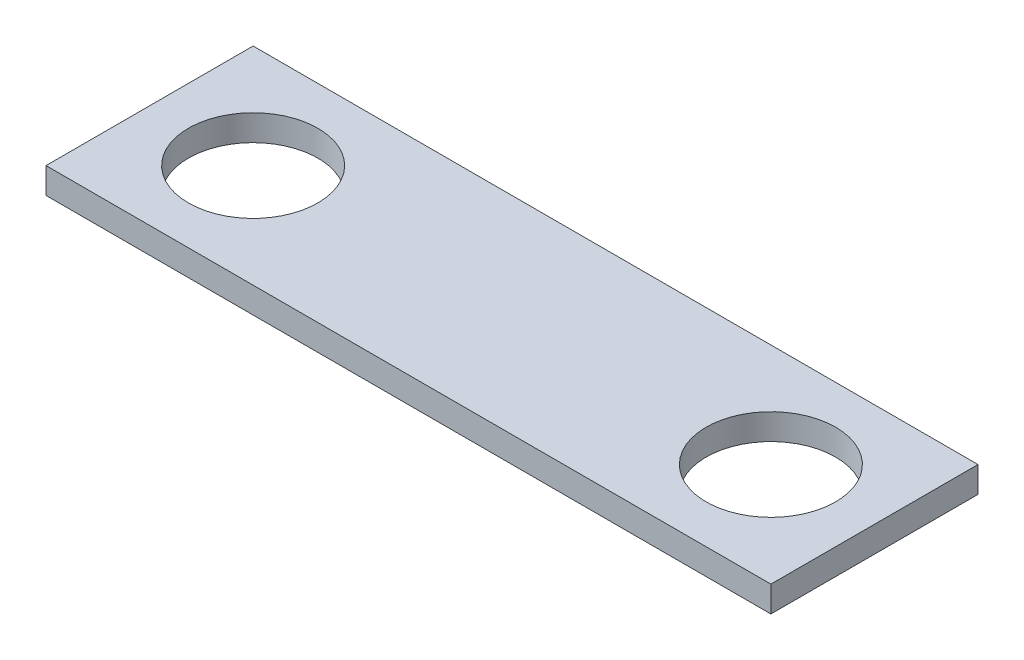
ISO-10303-21;
HEADER;
FILE_DESCRIPTION(('STEP AP214'),'2;1');
FILE_NAME('part.step','',(''),(''),'','','');
FILE_SCHEMA(('AUTOMOTIVE_DESIGN { 1 0 10303 214 1 1 1 1 }'));
ENDSEC;
DATA;
#1=APPLICATION_CONTEXT('core data for automotive mechanical design processes');
#2=APPLICATION_PROTOCOL_DEFINITION('international standard','automotive_design',2000,#1);
#3=PRODUCT_CONTEXT('',#1,'mechanical');
#4=PRODUCT('Part','Part','',(#3));
#5=PRODUCT_RELATED_PRODUCT_CATEGORY('part','',(#4));
#6=PRODUCT_DEFINITION_FORMATION('','',#4);
#7=PRODUCT_DEFINITION_CONTEXT('part definition',#1,'design');
#8=PRODUCT_DEFINITION('design','',#6,#7);
#9=PRODUCT_DEFINITION_SHAPE('','',#8);
#10=(LENGTH_UNIT() NAMED_UNIT(*) SI_UNIT(.MILLI.,.METRE.));
#11=(NAMED_UNIT(*) PLANE_ANGLE_UNIT() SI_UNIT($,.RADIAN.));
#12=(NAMED_UNIT(*) SI_UNIT($,.STERADIAN.) SOLID_ANGLE_UNIT());
#13=UNCERTAINTY_MEASURE_WITH_UNIT(LENGTH_MEASURE(1.E-05),#10,'distance_accuracy_value','');
#14=(GEOMETRIC_REPRESENTATION_CONTEXT(3) GLOBAL_UNCERTAINTY_ASSIGNED_CONTEXT((#13)) GLOBAL_UNIT_ASSIGNED_CONTEXT((#10,
#11,#12)) REPRESENTATION_CONTEXT('',''));
#15=CARTESIAN_POINT('',(0.,0.,0.));
#16=DIRECTION('',(0.,0.,1.));
#17=DIRECTION('',(1.,0.,0.));
#18=AXIS2_PLACEMENT_3D('',#15,#16,#17);
#19=CARTESIAN_POINT('',(0.,0.5,0.));
#20=DIRECTION('',(1.,0.,0.));
#21=DIRECTION('',(0.,0.,-1.));
#22=AXIS2_PLACEMENT_3D('',#19,#20,#21);
#23=PLANE('',#22);
#24=DIRECTION('',(0.,0.,1.));
#25=VECTOR('',#24,1.);
#26=CARTESIAN_POINT('',(0.,0.,0.));
#27=LINE('',#26,#25);
#28=CARTESIAN_POINT('',(0.,0.,-4.));
#29=VERTEX_POINT('',#28);
#30=CARTESIAN_POINT('',(0.,0.,0.));
#31=VERTEX_POINT('',#30);
#32=EDGE_CURVE('E97',#29,#31,#27,.T.);
#33=ORIENTED_EDGE('',*,*,#32,.T.);
#34=DIRECTION('',(0.,-1.,0.));
#35=VECTOR('',#34,1.);
#36=CARTESIAN_POINT('',(0.,0.5,0.));
#37=LINE('',#36,#35);
#38=CARTESIAN_POINT('',(0.,0.5,0.));
#39=VERTEX_POINT('',#38);
#40=EDGE_CURVE('E11',#39,#31,#37,.T.);
#41=ORIENTED_EDGE('',*,*,#40,.F.);
#42=DIRECTION('',(0.,0.,1.));
#43=VECTOR('',#42,1.);
#44=CARTESIAN_POINT('',(0.,0.5,0.));
#45=LINE('',#44,#43);
#46=CARTESIAN_POINT('',(0.,0.5,-4.));
#47=VERTEX_POINT('',#46);
#48=EDGE_CURVE('E85',#47,#39,#45,.T.);
#49=ORIENTED_EDGE('',*,*,#48,.F.);
#50=DIRECTION('',(0.,-1.,0.));
#51=VECTOR('',#50,1.);
#52=CARTESIAN_POINT('',(0.,0.5,-4.));
#53=LINE('',#52,#51);
#54=EDGE_CURVE('E93',#47,#29,#53,.T.);
#55=ORIENTED_EDGE('',*,*,#54,.T.);
#56=EDGE_LOOP('',(#33,#41,#49,#55));
#57=FACE_BOUND('',#56,.T.);
#58=ADVANCED_FACE('F34',(#57),#23,.F.);
#59=CARTESIAN_POINT('',(0.,0.5,0.));
#60=DIRECTION('',(0.,0.,-1.));
#61=DIRECTION('',(-1.,0.,0.));
#62=AXIS2_PLACEMENT_3D('',#59,#60,#61);
#63=PLANE('',#62);
#64=DIRECTION('',(1.,0.,0.));
#65=VECTOR('',#64,1.);
#66=CARTESIAN_POINT('',(0.,0.,0.));
#67=LINE('',#66,#65);
#68=CARTESIAN_POINT('',(14.,0.,0.));
#69=VERTEX_POINT('',#68);
#70=EDGE_CURVE('E89',#31,#69,#67,.T.);
#71=ORIENTED_EDGE('',*,*,#70,.T.);
#72=DIRECTION('',(0.,-1.,0.));
#73=VECTOR('',#72,1.);
#74=CARTESIAN_POINT('',(14.,0.5,0.));
#75=LINE('',#74,#73);
#76=CARTESIAN_POINT('',(14.,0.5,0.));
#77=VERTEX_POINT('',#76);
#78=EDGE_CURVE('E42',#77,#69,#75,.T.);
#79=ORIENTED_EDGE('',*,*,#78,.F.);
#80=DIRECTION('',(1.,0.,0.));
#81=VECTOR('',#80,1.);
#82=CARTESIAN_POINT('',(0.,0.5,0.));
#83=LINE('',#82,#81);
#84=EDGE_CURVE('E80',#39,#77,#83,.T.);
#85=ORIENTED_EDGE('',*,*,#84,.F.);
#86=ORIENTED_EDGE('',*,*,#40,.T.);
#87=EDGE_LOOP('',(#71,#79,#85,#86));
#88=FACE_BOUND('',#87,.T.);
#89=ADVANCED_FACE('F88',(#88),#63,.F.);
#90=CARTESIAN_POINT('',(14.,0.5,0.));
#91=DIRECTION('',(-1.,0.,0.));
#92=DIRECTION('',(0.,0.,1.));
#93=AXIS2_PLACEMENT_3D('',#90,#91,#92);
#94=PLANE('',#93);
#95=DIRECTION('',(0.,0.,-1.));
#96=VECTOR('',#95,1.);
#97=CARTESIAN_POINT('',(14.,0.,0.));
#98=LINE('',#97,#96);
#99=CARTESIAN_POINT('',(14.,0.,-4.));
#100=VERTEX_POINT('',#99);
#101=EDGE_CURVE('E67',#69,#100,#98,.T.);
#102=ORIENTED_EDGE('',*,*,#101,.T.);
#103=DIRECTION('',(0.,-1.,0.));
#104=VECTOR('',#103,1.);
#105=CARTESIAN_POINT('',(14.,0.5,-4.));
#106=LINE('',#105,#104);
#107=CARTESIAN_POINT('',(14.,0.5,-4.));
#108=VERTEX_POINT('',#107);
#109=EDGE_CURVE('E90',#108,#100,#106,.T.);
#110=ORIENTED_EDGE('',*,*,#109,.F.);
#111=DIRECTION('',(0.,0.,-1.));
#112=VECTOR('',#111,1.);
#113=CARTESIAN_POINT('',(14.,0.5,0.));
#114=LINE('',#113,#112);
#115=EDGE_CURVE('E83',#77,#108,#114,.T.);
#116=ORIENTED_EDGE('',*,*,#115,.F.);
#117=ORIENTED_EDGE('',*,*,#78,.T.);
#118=EDGE_LOOP('',(#102,#110,#116,#117));
#119=FACE_BOUND('',#118,.T.);
#120=ADVANCED_FACE('F91',(#119),#94,.F.);
#121=CARTESIAN_POINT('',(0.,0.5,-4.));
#122=DIRECTION('',(0.,0.,1.));
#123=DIRECTION('',(1.,0.,0.));
#124=AXIS2_PLACEMENT_3D('',#121,#122,#123);
#125=PLANE('',#124);
#126=DIRECTION('',(-1.,0.,0.));
#127=VECTOR('',#126,1.);
#128=CARTESIAN_POINT('',(0.,0.,-4.));
#129=LINE('',#128,#127);
#130=EDGE_CURVE('E73',#100,#29,#129,.T.);
#131=ORIENTED_EDGE('',*,*,#130,.T.);
#132=ORIENTED_EDGE('',*,*,#54,.F.);
#133=DIRECTION('',(-1.,0.,0.));
#134=VECTOR('',#133,1.);
#135=CARTESIAN_POINT('',(0.,0.5,-4.));
#136=LINE('',#135,#134);
#137=EDGE_CURVE('E50',#108,#47,#136,.T.);
#138=ORIENTED_EDGE('',*,*,#137,.F.);
#139=ORIENTED_EDGE('',*,*,#109,.T.);
#140=EDGE_LOOP('',(#131,#132,#138,#139));
#141=FACE_BOUND('',#140,.T.);
#142=ADVANCED_FACE('F105',(#141),#125,.F.);
#143=CARTESIAN_POINT('',(0.,0.5,-4.));
#144=DIRECTION('',(0.,-1.,0.));
#145=DIRECTION('',(0.,0.,-1.));
#146=AXIS2_PLACEMENT_3D('',#143,#144,#145);
#147=PLANE('',#146);
#148=CARTESIAN_POINT('',(12.,0.5,-2.));
#149=DIRECTION('',(0.,1.,0.));
#150=DIRECTION('',(0.,0.,-1.));
#151=AXIS2_PLACEMENT_3D('',#148,#149,#150);
#152=CIRCLE('',#151,1.25);
#153=CARTESIAN_POINT('',(12.,0.5,-3.25));
#154=VERTEX_POINT('',#153);
#155=EDGE_CURVE('E117',#154,#154,#152,.T.);
#156=ORIENTED_EDGE('',*,*,#155,.F.);
#157=EDGE_LOOP('',(#156));
#158=FACE_BOUND('',#157,.T.);
#159=CARTESIAN_POINT('',(2.,0.5,-2.));
#160=DIRECTION('',(0.,1.,0.));
#161=DIRECTION('',(0.,0.,1.));
#162=AXIS2_PLACEMENT_3D('',#159,#160,#161);
#163=CIRCLE('',#162,1.25);
#164=CARTESIAN_POINT('',(2.,0.5,-0.75));
#165=VERTEX_POINT('',#164);
#166=EDGE_CURVE('E111',#165,#165,#163,.T.);
#167=ORIENTED_EDGE('',*,*,#166,.F.);
#168=EDGE_LOOP('',(#167));
#169=FACE_BOUND('',#168,.T.);
#170=ORIENTED_EDGE('',*,*,#48,.T.);
#171=ORIENTED_EDGE('',*,*,#84,.T.);
#172=ORIENTED_EDGE('',*,*,#115,.T.);
#173=ORIENTED_EDGE('',*,*,#137,.T.);
#174=EDGE_LOOP('',(#170,#171,#172,#173));
#175=FACE_BOUND('',#174,.T.);
#176=ADVANCED_FACE('F81',(#158,#169,#175),#147,.F.);
#177=CARTESIAN_POINT('',(0.,0.,-4.));
#178=DIRECTION('',(0.,-1.,0.));
#179=DIRECTION('',(0.,0.,-1.));
#180=AXIS2_PLACEMENT_3D('',#177,#178,#179);
#181=PLANE('',#180);
#182=CARTESIAN_POINT('',(12.,0.,-2.));
#183=DIRECTION('',(0.,1.,0.));
#184=DIRECTION('',(0.,0.,-1.));
#185=AXIS2_PLACEMENT_3D('',#182,#183,#184);
#186=CIRCLE('',#185,1.25);
#187=CARTESIAN_POINT('',(12.,0.,-3.25));
#188=VERTEX_POINT('',#187);
#189=EDGE_CURVE('E114',#188,#188,#186,.T.);
#190=ORIENTED_EDGE('',*,*,#189,.T.);
#191=EDGE_LOOP('',(#190));
#192=FACE_BOUND('',#191,.T.);
#193=CARTESIAN_POINT('',(2.,0.,-2.));
#194=DIRECTION('',(0.,1.,0.));
#195=DIRECTION('',(0.,0.,1.));
#196=AXIS2_PLACEMENT_3D('',#193,#194,#195);
#197=CIRCLE('',#196,1.25);
#198=CARTESIAN_POINT('',(2.,0.,-0.75));
#199=VERTEX_POINT('',#198);
#200=EDGE_CURVE('E100',#199,#199,#197,.T.);
#201=ORIENTED_EDGE('',*,*,#200,.T.);
#202=EDGE_LOOP('',(#201));
#203=FACE_BOUND('',#202,.T.);
#204=ORIENTED_EDGE('',*,*,#32,.F.);
#205=ORIENTED_EDGE('',*,*,#130,.F.);
#206=ORIENTED_EDGE('',*,*,#101,.F.);
#207=ORIENTED_EDGE('',*,*,#70,.F.);
#208=EDGE_LOOP('',(#204,#205,#206,#207));
#209=FACE_BOUND('',#208,.T.);
#210=ADVANCED_FACE('F108',(#192,#203,#209),#181,.T.);
#211=CARTESIAN_POINT('',(2.,0.,-2.));
#212=DIRECTION('',(0.,1.,0.));
#213=DIRECTION('',(0.,0.,1.));
#214=AXIS2_PLACEMENT_3D('',#211,#212,#213);
#215=CYLINDRICAL_SURFACE('',#214,1.25);
#216=ORIENTED_EDGE('',*,*,#200,.F.);
#217=EDGE_LOOP('',(#216));
#218=FACE_BOUND('',#217,.T.);
#219=ORIENTED_EDGE('',*,*,#166,.T.);
#220=EDGE_LOOP('',(#219));
#221=FACE_BOUND('',#220,.T.);
#222=ADVANCED_FACE('F128',(#218,#221),#215,.F.);
#223=CARTESIAN_POINT('',(12.,0.,-2.));
#224=DIRECTION('',(0.,1.,0.));
#225=DIRECTION('',(0.,0.,1.));
#226=AXIS2_PLACEMENT_3D('',#223,#224,#225);
#227=CYLINDRICAL_SURFACE('',#226,1.25);
#228=ORIENTED_EDGE('',*,*,#189,.F.);
#229=EDGE_LOOP('',(#228));
#230=FACE_BOUND('',#229,.T.);
#231=ORIENTED_EDGE('',*,*,#155,.T.);
#232=EDGE_LOOP('',(#231));
#233=FACE_BOUND('',#232,.T.);
#234=ADVANCED_FACE('F125',(#230,#233),#227,.F.);
#235=CLOSED_SHELL('',(#58,#89,#120,#142,#176,#210,#222,#234));
#236=MANIFOLD_SOLID_BREP('B2',#235);
#237=ADVANCED_BREP_SHAPE_REPRESENTATION('',(#18,#236),#14);
#238=SHAPE_DEFINITION_REPRESENTATION(#9,#237);
ENDSEC;
END-ISO-10303-21;
